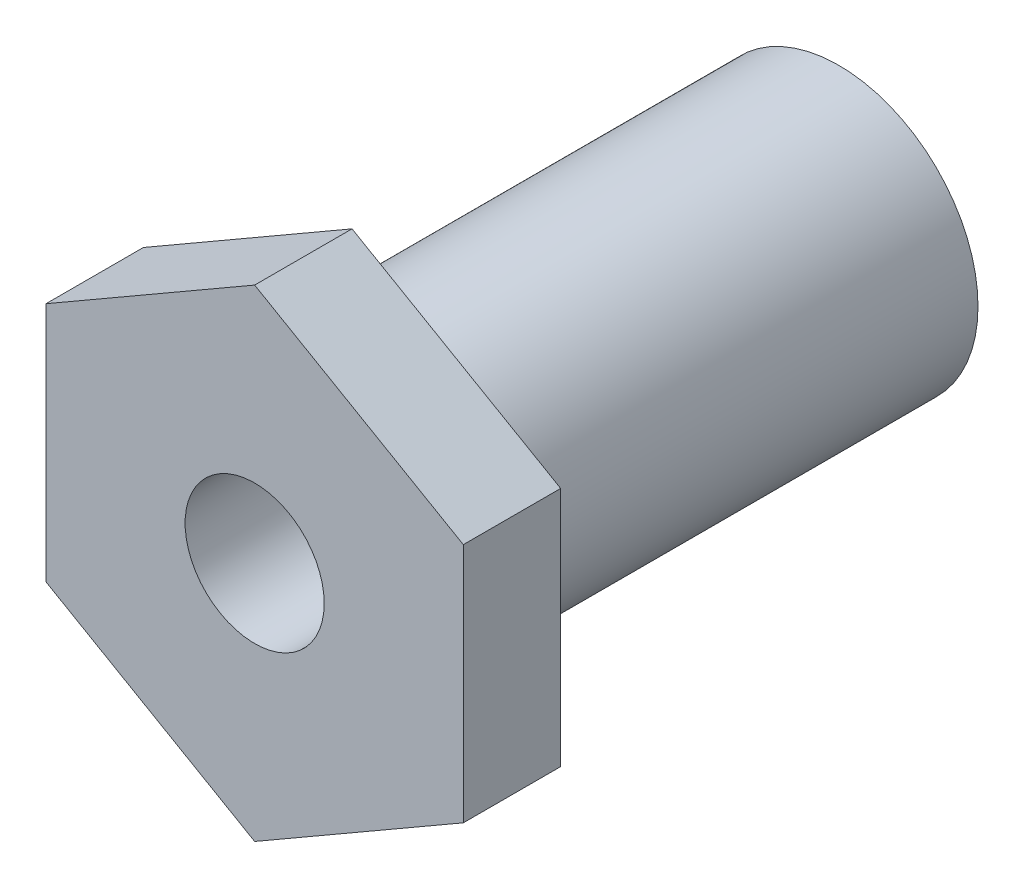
ISO-10303-21;
HEADER;
FILE_DESCRIPTION(('STEP AP214'),'2;1');
FILE_NAME('part.step','',(''),(''),'','','');
FILE_SCHEMA(('AUTOMOTIVE_DESIGN { 1 0 10303 214 1 1 1 1 }'));
ENDSEC;
DATA;
#1=APPLICATION_CONTEXT('core data for automotive mechanical design processes');
#2=APPLICATION_PROTOCOL_DEFINITION('international standard','automotive_design',2000,#1);
#3=PRODUCT_CONTEXT('',#1,'mechanical');
#4=PRODUCT('Part','Part','',(#3));
#5=PRODUCT_RELATED_PRODUCT_CATEGORY('part','',(#4));
#6=PRODUCT_DEFINITION_FORMATION('','',#4);
#7=PRODUCT_DEFINITION_CONTEXT('part definition',#1,'design');
#8=PRODUCT_DEFINITION('design','',#6,#7);
#9=PRODUCT_DEFINITION_SHAPE('','',#8);
#10=(LENGTH_UNIT() NAMED_UNIT(*) SI_UNIT(.MILLI.,.METRE.));
#11=(NAMED_UNIT(*) PLANE_ANGLE_UNIT() SI_UNIT($,.RADIAN.));
#12=(NAMED_UNIT(*) SI_UNIT($,.STERADIAN.) SOLID_ANGLE_UNIT());
#13=UNCERTAINTY_MEASURE_WITH_UNIT(LENGTH_MEASURE(1.E-05),#10,'distance_accuracy_value','');
#14=(GEOMETRIC_REPRESENTATION_CONTEXT(3) GLOBAL_UNCERTAINTY_ASSIGNED_CONTEXT((#13)) GLOBAL_UNIT_ASSIGNED_CONTEXT((#10,
#11,#12)) REPRESENTATION_CONTEXT('',''));
#15=CARTESIAN_POINT('',(0.,0.,0.));
#16=DIRECTION('',(0.,0.,1.));
#17=DIRECTION('',(1.,0.,0.));
#18=AXIS2_PLACEMENT_3D('',#15,#16,#17);
#19=CARTESIAN_POINT('',(0.,0.,30.));
#20=DIRECTION('',(0.,0.,1.));
#21=DIRECTION('',(1.,0.,0.));
#22=AXIS2_PLACEMENT_3D('',#19,#20,#21);
#23=PLANE('',#22);
#24=CARTESIAN_POINT('',(0.,0.,30.));
#25=DIRECTION('',(0.,0.,1.));
#26=DIRECTION('',(1.,0.,0.));
#27=AXIS2_PLACEMENT_3D('',#24,#25,#26);
#28=CIRCLE('',#27,5.);
#29=CARTESIAN_POINT('',(5.,0.,30.));
#30=VERTEX_POINT('',#29);
#31=EDGE_CURVE('E112',#30,#30,#28,.T.);
#32=ORIENTED_EDGE('',*,*,#31,.T.);
#33=EDGE_LOOP('',(#32));
#34=FACE_BOUND('',#33,.T.);
#35=ADVANCED_FACE('F14',(#34),#23,.T.);
#36=CARTESIAN_POINT('',(0.,0.,60.));
#37=DIRECTION('',(0.,0.,1.));
#38=DIRECTION('',(1.,0.,0.));
#39=AXIS2_PLACEMENT_3D('',#36,#37,#38);
#40=CYLINDRICAL_SURFACE('',#39,5.);
#41=CARTESIAN_POINT('',(0.,0.,42.));
#42=DIRECTION('',(0.,0.,1.));
#43=DIRECTION('',(1.,0.,0.));
#44=AXIS2_PLACEMENT_3D('',#41,#42,#43);
#45=CIRCLE('',#44,5.);
#46=CARTESIAN_POINT('',(5.,0.,42.));
#47=VERTEX_POINT('',#46);
#48=EDGE_CURVE('E109',#47,#47,#45,.T.);
#49=ORIENTED_EDGE('',*,*,#48,.T.);
#50=EDGE_LOOP('',(#49));
#51=FACE_BOUND('',#50,.T.);
#52=ORIENTED_EDGE('',*,*,#31,.F.);
#53=EDGE_LOOP('',(#52));
#54=FACE_BOUND('',#53,.T.);
#55=ADVANCED_FACE('F151',(#51,#54),#40,.F.);
#56=CARTESIAN_POINT('',(-5.,0.,42.));
#57=DIRECTION('',(0.,0.,1.));
#58=DIRECTION('',(1.,0.,0.));
#59=AXIS2_PLACEMENT_3D('',#56,#57,#58);
#60=PLANE('',#59);
#61=DIRECTION('',(-0.866025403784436,-0.5,0.));
#62=VECTOR('',#61,1.);
#63=CARTESIAN_POINT('',(15.,-8.66025403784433,42.));
#64=LINE('',#63,#62);
#65=CARTESIAN_POINT('',(15.,-8.66025403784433,42.));
#66=VERTEX_POINT('',#65);
#67=CARTESIAN_POINT('',(0.,-17.3205080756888,42.));
#68=VERTEX_POINT('',#67);
#69=EDGE_CURVE('E80',#66,#68,#64,.T.);
#70=ORIENTED_EDGE('',*,*,#69,.F.);
#71=DIRECTION('',(0.,1.,0.));
#72=VECTOR('',#71,1.);
#73=CARTESIAN_POINT('',(15.,-8.66025403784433,42.));
#74=LINE('',#73,#72);
#75=CARTESIAN_POINT('',(15.,8.66025403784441,42.));
#76=VERTEX_POINT('',#75);
#77=EDGE_CURVE('E97',#66,#76,#74,.T.);
#78=ORIENTED_EDGE('',*,*,#77,.T.);
#79=DIRECTION('',(-0.86602540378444,0.5,0.));
#80=VECTOR('',#79,1.);
#81=CARTESIAN_POINT('',(15.,8.66025403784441,42.));
#82=LINE('',#81,#80);
#83=CARTESIAN_POINT('',(0.,17.3205080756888,42.));
#84=VERTEX_POINT('',#83);
#85=EDGE_CURVE('E28',#76,#84,#82,.T.);
#86=ORIENTED_EDGE('',*,*,#85,.T.);
#87=DIRECTION('',(0.86602540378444,0.5,0.));
#88=VECTOR('',#87,1.);
#89=CARTESIAN_POINT('',(-15.,8.66025403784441,42.));
#90=LINE('',#89,#88);
#91=CARTESIAN_POINT('',(-15.,8.66025403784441,42.));
#92=VERTEX_POINT('',#91);
#93=EDGE_CURVE('E91',#92,#84,#90,.T.);
#94=ORIENTED_EDGE('',*,*,#93,.F.);
#95=DIRECTION('',(0.,1.,0.));
#96=VECTOR('',#95,1.);
#97=CARTESIAN_POINT('',(-15.,-8.66025403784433,42.));
#98=LINE('',#97,#96);
#99=CARTESIAN_POINT('',(-15.,-8.66025403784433,42.));
#100=VERTEX_POINT('',#99);
#101=EDGE_CURVE('E89',#100,#92,#98,.T.);
#102=ORIENTED_EDGE('',*,*,#101,.F.);
#103=DIRECTION('',(0.866025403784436,-0.5,0.));
#104=VECTOR('',#103,1.);
#105=CARTESIAN_POINT('',(-15.,-8.66025403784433,42.));
#106=LINE('',#105,#104);
#107=EDGE_CURVE('E71',#100,#68,#106,.T.);
#108=ORIENTED_EDGE('',*,*,#107,.T.);
#109=EDGE_LOOP('',(#70,#78,#86,#94,#102,#108));
#110=FACE_BOUND('',#109,.T.);
#111=ORIENTED_EDGE('',*,*,#48,.F.);
#112=EDGE_LOOP('',(#111));
#113=FACE_BOUND('',#112,.T.);
#114=ADVANCED_FACE('F85',(#110,#113),#60,.T.);
#115=CARTESIAN_POINT('',(15.,-8.66025403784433,32.));
#116=DIRECTION('',(-0.5,0.866025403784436,0.));
#117=DIRECTION('',(-0.866025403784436,-0.5,0.));
#118=AXIS2_PLACEMENT_3D('',#115,#116,#117);
#119=PLANE('',#118);
#120=DIRECTION('',(0.866025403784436,0.5,0.));
#121=VECTOR('',#120,1.);
#122=CARTESIAN_POINT('',(-7.49999999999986,-21.650635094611,35.));
#123=LINE('',#122,#121);
#124=CARTESIAN_POINT('',(0.,-17.3205080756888,35.));
#125=VERTEX_POINT('',#124);
#126=CARTESIAN_POINT('',(15.,-8.66025403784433,35.));
#127=VERTEX_POINT('',#126);
#128=EDGE_CURVE('E9',#125,#127,#123,.T.);
#129=ORIENTED_EDGE('',*,*,#128,.T.);
#130=DIRECTION('',(0.,0.,1.));
#131=VECTOR('',#130,1.);
#132=CARTESIAN_POINT('',(15.,-8.66025403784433,32.));
#133=LINE('',#132,#131);
#134=EDGE_CURVE('E36',#127,#66,#133,.T.);
#135=ORIENTED_EDGE('',*,*,#134,.T.);
#136=ORIENTED_EDGE('',*,*,#69,.T.);
#137=DIRECTION('',(0.,0.,1.));
#138=VECTOR('',#137,1.);
#139=CARTESIAN_POINT('',(0.,-17.3205080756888,32.));
#140=LINE('',#139,#138);
#141=EDGE_CURVE('E66',#125,#68,#140,.T.);
#142=ORIENTED_EDGE('',*,*,#141,.F.);
#143=EDGE_LOOP('',(#129,#135,#136,#142));
#144=FACE_BOUND('',#143,.T.);
#145=ADVANCED_FACE('F81',(#144),#119,.F.);
#146=CARTESIAN_POINT('',(-15.,-8.66025403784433,32.));
#147=DIRECTION('',(-0.5,-0.866025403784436,0.));
#148=DIRECTION('',(0.866025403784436,-0.5,0.));
#149=AXIS2_PLACEMENT_3D('',#146,#147,#148);
#150=PLANE('',#149);
#151=ORIENTED_EDGE('',*,*,#141,.T.);
#152=ORIENTED_EDGE('',*,*,#107,.F.);
#153=DIRECTION('',(0.,0.,1.));
#154=VECTOR('',#153,1.);
#155=CARTESIAN_POINT('',(-15.,-8.66025403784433,32.));
#156=LINE('',#155,#154);
#157=CARTESIAN_POINT('',(-15.,-8.66025403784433,35.));
#158=VERTEX_POINT('',#157);
#159=EDGE_CURVE('E77',#158,#100,#156,.T.);
#160=ORIENTED_EDGE('',*,*,#159,.F.);
#161=DIRECTION('',(-0.866025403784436,0.5,0.));
#162=VECTOR('',#161,1.);
#163=CARTESIAN_POINT('',(-22.5,-4.33012701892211,35.));
#164=LINE('',#163,#162);
#165=EDGE_CURVE('E21',#125,#158,#164,.T.);
#166=ORIENTED_EDGE('',*,*,#165,.F.);
#167=EDGE_LOOP('',(#151,#152,#160,#166));
#168=FACE_BOUND('',#167,.T.);
#169=ADVANCED_FACE('F68',(#168),#150,.T.);
#170=CARTESIAN_POINT('',(-15.,-8.66025403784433,32.));
#171=DIRECTION('',(1.,0.,0.));
#172=DIRECTION('',(0.,0.,-1.));
#173=AXIS2_PLACEMENT_3D('',#170,#171,#172);
#174=PLANE('',#173);
#175=DIRECTION('',(0.,-1.,0.));
#176=VECTOR('',#175,1.);
#177=CARTESIAN_POINT('',(-15.,0.,35.));
#178=LINE('',#177,#176);
#179=CARTESIAN_POINT('',(-15.,8.66025403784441,35.));
#180=VERTEX_POINT('',#179);
#181=EDGE_CURVE('E123',#180,#158,#178,.T.);
#182=ORIENTED_EDGE('',*,*,#181,.T.);
#183=ORIENTED_EDGE('',*,*,#159,.T.);
#184=ORIENTED_EDGE('',*,*,#101,.T.);
#185=DIRECTION('',(0.,0.,1.));
#186=VECTOR('',#185,1.);
#187=CARTESIAN_POINT('',(-15.,8.66025403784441,32.));
#188=LINE('',#187,#186);
#189=EDGE_CURVE('E101',#180,#92,#188,.T.);
#190=ORIENTED_EDGE('',*,*,#189,.F.);
#191=EDGE_LOOP('',(#182,#183,#184,#190));
#192=FACE_BOUND('',#191,.T.);
#193=ADVANCED_FACE('F139',(#192),#174,.F.);
#194=CARTESIAN_POINT('',(-15.,8.66025403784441,32.));
#195=DIRECTION('',(0.5,-0.86602540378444,0.));
#196=DIRECTION('',(0.86602540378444,0.5,0.));
#197=AXIS2_PLACEMENT_3D('',#194,#195,#196);
#198=PLANE('',#197);
#199=DIRECTION('',(-0.86602540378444,-0.5,0.));
#200=VECTOR('',#199,1.);
#201=CARTESIAN_POINT('',(-22.5,4.33012701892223,35.));
#202=LINE('',#201,#200);
#203=CARTESIAN_POINT('',(0.,17.3205080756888,35.));
#204=VERTEX_POINT('',#203);
#205=EDGE_CURVE('E121',#204,#180,#202,.T.);
#206=ORIENTED_EDGE('',*,*,#205,.T.);
#207=ORIENTED_EDGE('',*,*,#189,.T.);
#208=ORIENTED_EDGE('',*,*,#93,.T.);
#209=DIRECTION('',(0.,0.,1.));
#210=VECTOR('',#209,1.);
#211=CARTESIAN_POINT('',(0.,17.3205080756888,32.));
#212=LINE('',#211,#210);
#213=EDGE_CURVE('E99',#204,#84,#212,.T.);
#214=ORIENTED_EDGE('',*,*,#213,.F.);
#215=EDGE_LOOP('',(#206,#207,#208,#214));
#216=FACE_BOUND('',#215,.T.);
#217=ADVANCED_FACE('F134',(#216),#198,.F.);
#218=CARTESIAN_POINT('',(15.,8.66025403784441,32.));
#219=DIRECTION('',(0.5,0.86602540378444,0.));
#220=DIRECTION('',(-0.86602540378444,0.5,0.));
#221=AXIS2_PLACEMENT_3D('',#218,#219,#220);
#222=PLANE('',#221);
#223=ORIENTED_EDGE('',*,*,#213,.T.);
#224=ORIENTED_EDGE('',*,*,#85,.F.);
#225=DIRECTION('',(0.,0.,1.));
#226=VECTOR('',#225,1.);
#227=CARTESIAN_POINT('',(15.,8.66025403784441,32.));
#228=LINE('',#227,#226);
#229=CARTESIAN_POINT('',(15.,8.66025403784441,35.));
#230=VERTEX_POINT('',#229);
#231=EDGE_CURVE('E96',#230,#76,#228,.T.);
#232=ORIENTED_EDGE('',*,*,#231,.F.);
#233=DIRECTION('',(0.86602540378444,-0.5,0.));
#234=VECTOR('',#233,1.);
#235=CARTESIAN_POINT('',(-7.5,21.650635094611,35.));
#236=LINE('',#235,#234);
#237=EDGE_CURVE('E118',#204,#230,#236,.T.);
#238=ORIENTED_EDGE('',*,*,#237,.F.);
#239=EDGE_LOOP('',(#223,#224,#232,#238));
#240=FACE_BOUND('',#239,.T.);
#241=ADVANCED_FACE('F130',(#240),#222,.T.);
#242=CARTESIAN_POINT('',(15.,-8.66025403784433,32.));
#243=DIRECTION('',(1.,0.,0.));
#244=DIRECTION('',(0.,0.,-1.));
#245=AXIS2_PLACEMENT_3D('',#242,#243,#244);
#246=PLANE('',#245);
#247=ORIENTED_EDGE('',*,*,#231,.T.);
#248=ORIENTED_EDGE('',*,*,#77,.F.);
#249=ORIENTED_EDGE('',*,*,#134,.F.);
#250=DIRECTION('',(0.,-1.,0.));
#251=VECTOR('',#250,1.);
#252=CARTESIAN_POINT('',(15.,0.,35.));
#253=LINE('',#252,#251);
#254=EDGE_CURVE('E115',#230,#127,#253,.T.);
#255=ORIENTED_EDGE('',*,*,#254,.F.);
#256=EDGE_LOOP('',(#247,#248,#249,#255));
#257=FACE_BOUND('',#256,.T.);
#258=ADVANCED_FACE('F129',(#257),#246,.T.);
#259=CARTESIAN_POINT('',(-10.,0.,0.));
#260=DIRECTION('',(0.,0.,-1.));
#261=DIRECTION('',(-1.,0.,0.));
#262=AXIS2_PLACEMENT_3D('',#259,#260,#261);
#263=PLANE('',#262);
#264=CARTESIAN_POINT('',(0.,0.,0.));
#265=DIRECTION('',(0.,0.,1.));
#266=DIRECTION('',(1.,0.,0.));
#267=AXIS2_PLACEMENT_3D('',#264,#265,#266);
#268=CIRCLE('',#267,10.);
#269=CARTESIAN_POINT('',(10.,0.,0.));
#270=VERTEX_POINT('',#269);
#271=EDGE_CURVE('E76',#270,#270,#268,.T.);
#272=ORIENTED_EDGE('',*,*,#271,.F.);
#273=EDGE_LOOP('',(#272));
#274=FACE_BOUND('',#273,.T.);
#275=ADVANCED_FACE('F171',(#274),#263,.T.);
#276=CARTESIAN_POINT('',(0.,0.,60.));
#277=DIRECTION('',(0.,0.,1.));
#278=DIRECTION('',(1.,0.,0.));
#279=AXIS2_PLACEMENT_3D('',#276,#277,#278);
#280=CYLINDRICAL_SURFACE('',#279,10.);
#281=ORIENTED_EDGE('',*,*,#271,.T.);
#282=EDGE_LOOP('',(#281));
#283=FACE_BOUND('',#282,.T.);
#284=CARTESIAN_POINT('',(0.,0.,35.));
#285=DIRECTION('',(0.,0.,1.));
#286=DIRECTION('',(1.,0.,0.));
#287=AXIS2_PLACEMENT_3D('',#284,#285,#286);
#288=CIRCLE('',#287,10.);
#289=CARTESIAN_POINT('',(10.,0.,35.));
#290=VERTEX_POINT('',#289);
#291=EDGE_CURVE('E106',#290,#290,#288,.T.);
#292=ORIENTED_EDGE('',*,*,#291,.F.);
#293=EDGE_LOOP('',(#292));
#294=FACE_BOUND('',#293,.T.);
#295=ADVANCED_FACE('F168',(#283,#294),#280,.T.);
#296=CARTESIAN_POINT('',(-20.,0.,35.));
#297=DIRECTION('',(0.,0.,-1.));
#298=DIRECTION('',(-1.,0.,0.));
#299=AXIS2_PLACEMENT_3D('',#296,#297,#298);
#300=PLANE('',#299);
#301=ORIENTED_EDGE('',*,*,#128,.F.);
#302=ORIENTED_EDGE('',*,*,#165,.T.);
#303=ORIENTED_EDGE('',*,*,#181,.F.);
#304=ORIENTED_EDGE('',*,*,#205,.F.);
#305=ORIENTED_EDGE('',*,*,#237,.T.);
#306=ORIENTED_EDGE('',*,*,#254,.T.);
#307=EDGE_LOOP('',(#301,#302,#303,#304,#305,#306));
#308=FACE_BOUND('',#307,.T.);
#309=ORIENTED_EDGE('',*,*,#291,.T.);
#310=EDGE_LOOP('',(#309));
#311=FACE_BOUND('',#310,.T.);
#312=ADVANCED_FACE('F126',(#308,#311),#300,.T.);
#313=CLOSED_SHELL('',(#35,#55,#114,#145,#169,#193,#217,#241,#258,#275,#295,#312));
#314=MANIFOLD_SOLID_BREP('B1',#313);
#315=ADVANCED_BREP_SHAPE_REPRESENTATION('',(#18,#314),#14);
#316=SHAPE_DEFINITION_REPRESENTATION(#9,#315);
ENDSEC;
END-ISO-10303-21;
